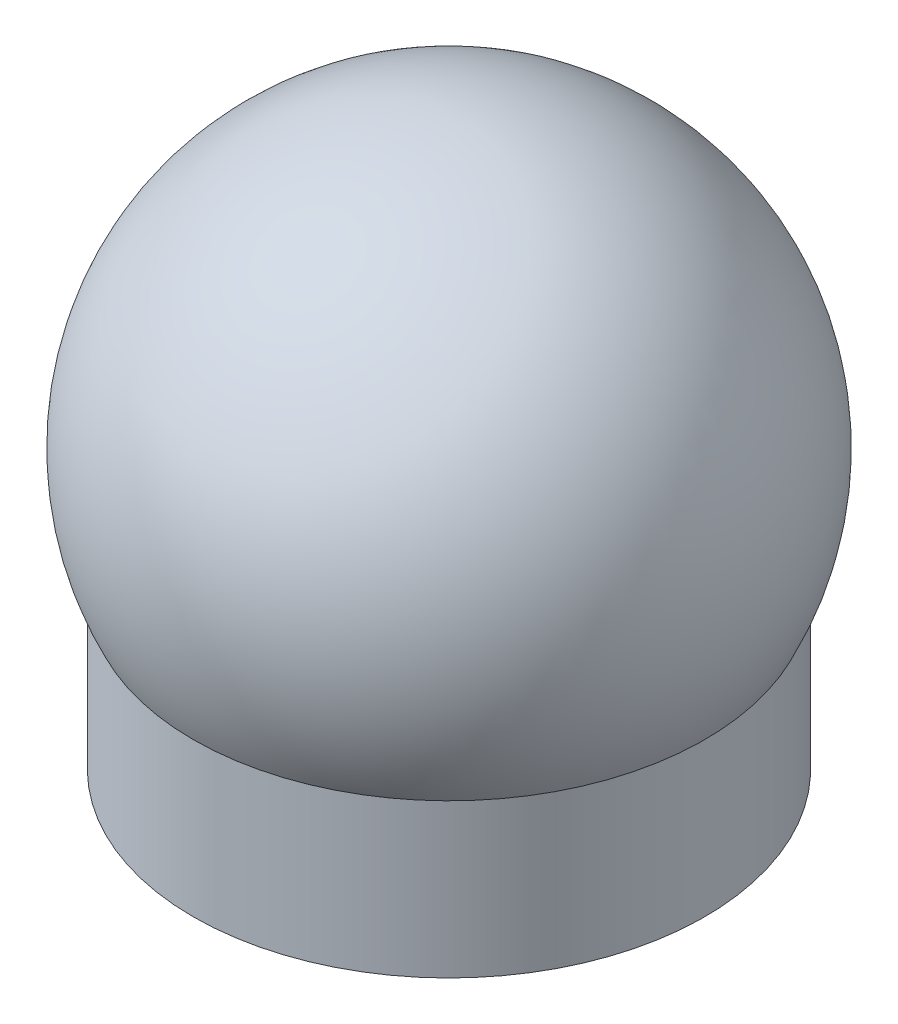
ISO-10303-21;
HEADER;
FILE_DESCRIPTION(('STEP AP214'),'2;1');
FILE_NAME('part.step','',(''),(''),'','','');
FILE_SCHEMA(('AUTOMOTIVE_DESIGN { 1 0 10303 214 1 1 1 1 }'));
ENDSEC;
DATA;
#1=APPLICATION_CONTEXT('core data for automotive mechanical design processes');
#2=APPLICATION_PROTOCOL_DEFINITION('international standard','automotive_design',2000,#1);
#3=PRODUCT_CONTEXT('',#1,'mechanical');
#4=PRODUCT('Part','Part','',(#3));
#5=PRODUCT_RELATED_PRODUCT_CATEGORY('part','',(#4));
#6=PRODUCT_DEFINITION_FORMATION('','',#4);
#7=PRODUCT_DEFINITION_CONTEXT('part definition',#1,'design');
#8=PRODUCT_DEFINITION('design','',#6,#7);
#9=PRODUCT_DEFINITION_SHAPE('','',#8);
#10=(LENGTH_UNIT() NAMED_UNIT(*) SI_UNIT(.MILLI.,.METRE.));
#11=(NAMED_UNIT(*) PLANE_ANGLE_UNIT() SI_UNIT($,.RADIAN.));
#12=(NAMED_UNIT(*) SI_UNIT($,.STERADIAN.) SOLID_ANGLE_UNIT());
#13=UNCERTAINTY_MEASURE_WITH_UNIT(LENGTH_MEASURE(1.E-05),#10,'distance_accuracy_value','');
#14=(GEOMETRIC_REPRESENTATION_CONTEXT(3) GLOBAL_UNCERTAINTY_ASSIGNED_CONTEXT((#13)) GLOBAL_UNIT_ASSIGNED_CONTEXT((#10,
#11,#12)) REPRESENTATION_CONTEXT('',''));
#15=CARTESIAN_POINT('',(0.,0.,0.));
#16=DIRECTION('',(0.,0.,1.));
#17=DIRECTION('',(1.,0.,0.));
#18=AXIS2_PLACEMENT_3D('',#15,#16,#17);
#19=CARTESIAN_POINT('',(0.,30.,0.));
#20=DIRECTION('',(0.,-1.,0.));
#21=DIRECTION('',(0.,0.,-1.));
#22=AXIS2_PLACEMENT_3D('',#19,#20,#21);
#23=CYLINDRICAL_SURFACE('',#22,50.);
#24=CARTESIAN_POINT('',(0.,30.,0.));
#25=DIRECTION('',(0.,1.,0.));
#26=DIRECTION('',(0.,0.,1.));
#27=AXIS2_PLACEMENT_3D('',#24,#25,#26);
#28=CIRCLE('',#27,50.);
#29=CARTESIAN_POINT('',(0.,30.,50.));
#30=VERTEX_POINT('',#29);
#31=EDGE_CURVE('E10',#30,#30,#28,.T.);
#32=ORIENTED_EDGE('',*,*,#31,.F.);
#33=EDGE_LOOP('',(#32));
#34=FACE_BOUND('',#33,.T.);
#35=CARTESIAN_POINT('',(0.,0.,0.));
#36=DIRECTION('',(0.,1.,0.));
#37=DIRECTION('',(0.,0.,1.));
#38=AXIS2_PLACEMENT_3D('',#35,#36,#37);
#39=CIRCLE('',#38,50.);
#40=CARTESIAN_POINT('',(0.,0.,50.));
#41=VERTEX_POINT('',#40);
#42=EDGE_CURVE('E37',#41,#41,#39,.T.);
#43=ORIENTED_EDGE('',*,*,#42,.T.);
#44=EDGE_LOOP('',(#43));
#45=FACE_BOUND('',#44,.T.);
#46=ADVANCED_FACE('F30',(#34,#45),#23,.T.);
#47=CARTESIAN_POINT('',(0.,54.375,0.));
#48=DIRECTION('',(0.,0.,1.));
#49=DIRECTION('',(1.,0.,0.));
#50=AXIS2_PLACEMENT_3D('',#47,#48,#49);
#51=SPHERICAL_SURFACE('',#50,55.625);
#52=CARTESIAN_POINT('',(0.,54.375,0.));
#53=DIRECTION('',(0.,1.,0.));
#54=DIRECTION('',(0.,0.,1.));
#55=AXIS2_PLACEMENT_3D('',#52,#53,#54);
#56=SPHERICAL_SURFACE('',#55,55.625);
#57=ORIENTED_EDGE('',*,*,#31,.T.);
#58=EDGE_LOOP('',(#57));
#59=FACE_BOUND('',#58,.T.);
#60=ADVANCED_FACE('F32',(#59),#56,.T.);
#61=CARTESIAN_POINT('',(0.,0.,0.));
#62=DIRECTION('',(0.,1.,0.));
#63=DIRECTION('',(0.,0.,1.));
#64=AXIS2_PLACEMENT_3D('',#61,#62,#63);
#65=PLANE('',#64);
#66=ORIENTED_EDGE('',*,*,#42,.F.);
#67=EDGE_LOOP('',(#66));
#68=FACE_BOUND('',#67,.T.);
#69=ADVANCED_FACE('F44',(#68),#65,.F.);
#70=CLOSED_SHELL('',(#46,#60,#69));
#71=MANIFOLD_SOLID_BREP('B2',#70);
#72=ADVANCED_BREP_SHAPE_REPRESENTATION('',(#18,#71),#14);
#73=SHAPE_DEFINITION_REPRESENTATION(#9,#72);
ENDSEC;
END-ISO-10303-21;
